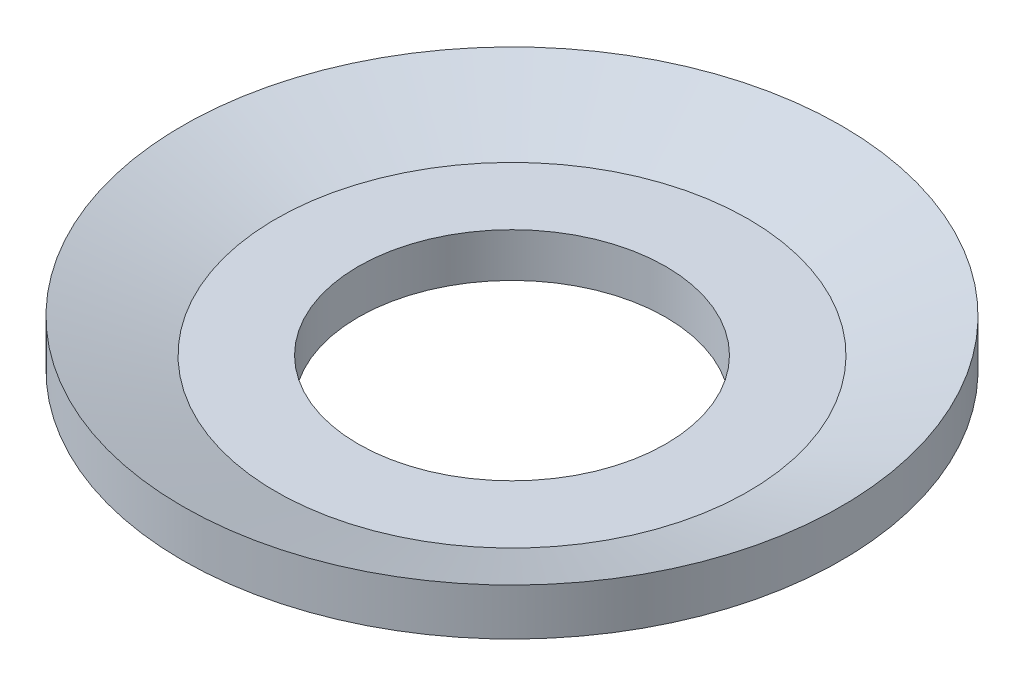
from build123d import *


with BuildPart() as part:
    # Sketch1 → Revolve1 (revolve)
    with BuildSketch(Plane.XY, mode=Mode.PRIVATE) as revolve1_sk:
        with BuildLine():
            Line((2.15, 0.4), (3, 0.709374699))
            Line((3, 0.709374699), (3, 0.28370359))
            Line((3, 0.28370359), (2.286808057, 0.024122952))
            ThreePointArc((2.286808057, 0.024122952), (2.219459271, 0.006076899), (2.15, 0))
            Line((2.15, 0), (1.4, 0))
            Line((1.4, 0), (1.4, 0.4))
            Line((1.4, 0.4), (2.15, 0.4))
        make_face()
    revolve(revolve1_sk.sketch.rotate(Axis((0, 0, 0), (0, 1, 0)), 90), axis=Axis((0, 0, 0), (0, 1, 0)))


solid = part.part
